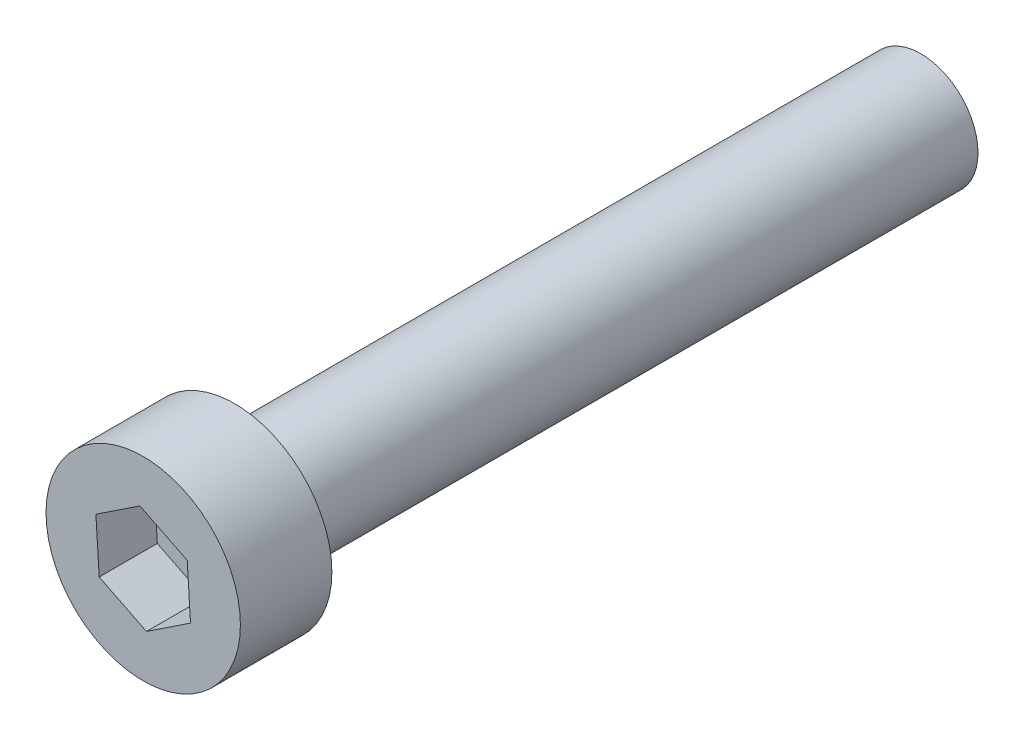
from build123d import *

# Parameters (mm, degrees)
SKETCH1_R           = 2.5
BOSS_EXTRUDE1_DEPTH = 30
SKETCH2_R           = 4.25
BOSS_EXTRUDE2_DEPTH = 4
CUT_EXTRUDE1_DEPTH  = 2.54


with BuildPart() as part:
    # Sketch1 → Boss-Extrude1 (new body)
    with BuildSketch(Plane.XY):
        Circle(SKETCH1_R)
    extrude(amount=BOSS_EXTRUDE1_DEPTH)

    # Sketch2 → Boss-Extrude2 (add)
    with BuildSketch(Plane.XY.offset(30)):
        Circle(SKETCH2_R)
    extrude(amount=BOSS_EXTRUDE2_DEPTH)

    # Sketch3 → Cut-Extrude1 (cut)
    with BuildSketch(Plane.XY.offset(34)):
        Polygon((2.068052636, -1.027857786), (1.924177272, 1.277057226), (-0.143875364, 2.304915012), (-2.068052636, 1.027857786), (-1.924177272, -1.277057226), (0.143875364, -2.304915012), align=None)
    extrude(amount=-CUT_EXTRUDE1_DEPTH, mode=Mode.SUBTRACT)


solid = part.part
